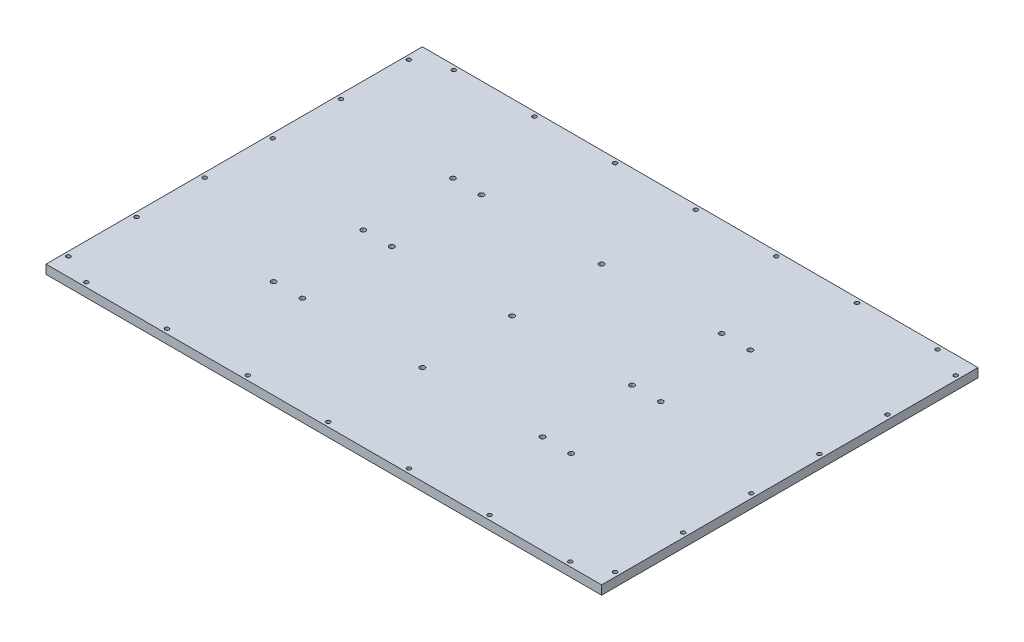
from build123d import *

# Parameters (mm, degrees)
SKETCH_1_W            = 620
SKETCH_1_H            = 420
EXTRUDE_1_DEPTH       = 10
HOLE_WIZARD_M41_D     = 4.5
HOLE_WIZARD_M41_DEPTH = 20
HOLE_WIZARD_M41_TIP   = 1.351936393
HOLE_WIZARD_M5_D      = 5.5
HOLE_WIZARD_M5_DEPTH  = 10
HOLE_WIZARD_M5_TIP    = 1.652366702


with BuildPart() as part:
    # Sketch 1 → Extrude 1 (new body)
    with BuildSketch(Plane(origin=(0, 0, 0), x_dir=(1, 0, 0), z_dir=(0, 1, 0))):
        Rectangle(SKETCH_1_W, SKETCH_1_H)
    extrude(amount=EXTRUDE_1_DEPTH)

    # Hole Wizard M41
    with Locations(Plane(origin=(1.472976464, -10, 2.937580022), x_dir=(1, 0, 0), z_dir=(0, -1, 0))):
        with Locations((303.527023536, 187.062419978), (303.527023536, 111.062419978), (303.527023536, 35.062419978), (303.527023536, -40.937580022), (178.527023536, 202.062419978), (88.527023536, 202.062419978), (-1.472976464, 202.062419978), (-91.472976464, 202.062419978), (268.527023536, 202.062419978), (-181.472976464, 202.062419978), (-271.472976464, 202.062419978), (-306.472976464, 187.062419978), (-306.472976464, 111.062419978), (-306.472976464, 35.062419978), (-306.472976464, -40.937580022), (-306.472976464, -116.937580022), (-306.472976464, -192.937580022), (-271.472976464, -207.937580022), (-181.472976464, -207.937580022), (-91.472976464, -207.937580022), (-1.472976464, -207.937580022), (88.527023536, -207.937580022), (178.527023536, -207.937580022), (268.527023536, -207.937580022), (303.527023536, -192.937580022), (303.527023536, -116.937580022)):
            Hole(HOLE_WIZARD_M41_D / 2, depth=HOLE_WIZARD_M41_DEPTH)
            with Locations((0, 0, -(HOLE_WIZARD_M41_DEPTH + HOLE_WIZARD_M41_TIP / 2))):  # 118° drill point
                Cone(0, HOLE_WIZARD_M41_D / 2, HOLE_WIZARD_M41_TIP, mode=Mode.SUBTRACT)

    # Hole Wizard M5
    with Locations(Plane(origin=(1.472976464, 10, 2.937580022), x_dir=(-1, 0, 0), z_dir=(0, 1, 0))):
        with Locations((167.472976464, 97.062419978), (167.472976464, -102.937580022), (167.472976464, -2.937580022), (-132.527023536, 97.062419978), (-164.527023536, 97.062419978), (-164.527023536, -102.937580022), (-132.527023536, -102.937580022), (135.472976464, -2.937580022), (-132.527023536, -2.937580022), (-164.527023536, -2.937580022), (135.472976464, -102.937580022), (135.472976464, 97.062419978), (1.472976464, -2.937580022), (1.472976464, 97.062419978), (1.472976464, -102.937580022)):
            Hole(HOLE_WIZARD_M5_D / 2, depth=HOLE_WIZARD_M5_DEPTH)
            with Locations((0, 0, -(HOLE_WIZARD_M5_DEPTH + HOLE_WIZARD_M5_TIP / 2))):  # 118° drill point
                Cone(0, HOLE_WIZARD_M5_D / 2, HOLE_WIZARD_M5_TIP, mode=Mode.SUBTRACT)


solid = part.part
